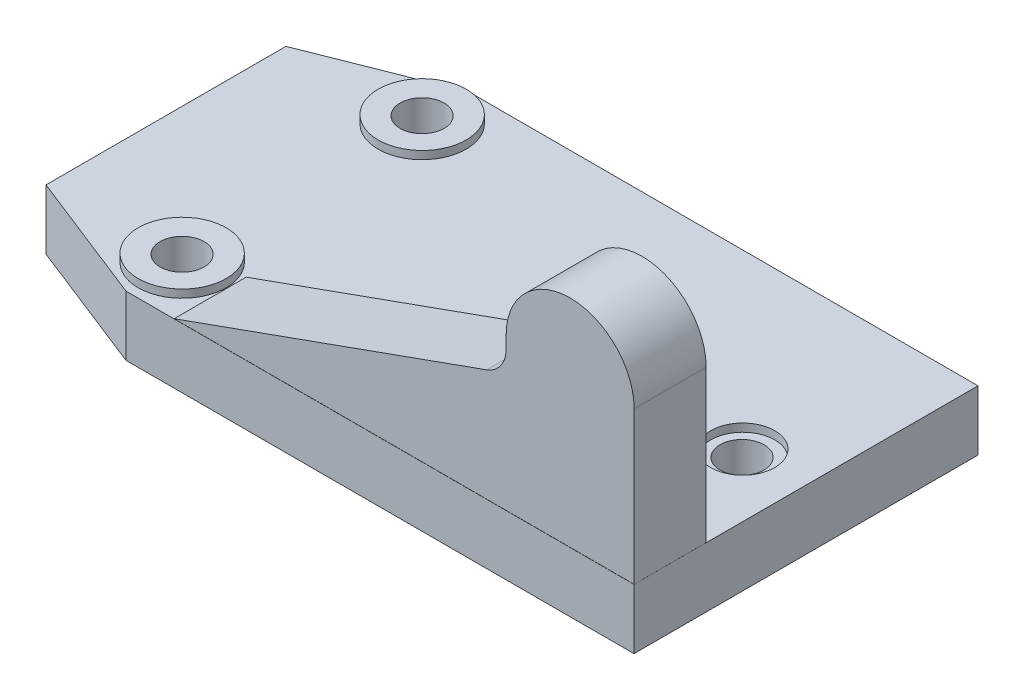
from build123d import *

# Parameters (mm, degrees)
EXTRUSION1_DEPTH        = 15
ESQUISSE4_R             = 11
EXTRUSION3_DEPTH        = 2
ESQUISSE8_R             = 5.5
ENL_V_MAT_EXTRU_4_DEPTH = 184.359126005
ESQUISSE9_R             = 8
ENL_V_MAT_EXTRU_5_DEPTH = 2
EXTRUSION4_DEPTH        = 18


with BuildPart() as part:
    # Esquisse2 → Extrusion1 (new body)
    with BuildSketch(Plane(origin=(0, 0, 0), x_dir=(1, 0, 0), z_dir=(0, 1, 0))):
        Polygon((0, 0), (0, 86), (-127, 86), (-160, 73), (-160, 13), (-127, 0), align=None)
    extrude(amount=EXTRUSION1_DEPTH)

    # Esquisse4 → Extrusion3 (add)
    with BuildSketch(Plane(origin=(-253.198641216, 15, -86.244437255), x_dir=(-1, 0, 0), z_dir=(0, 1, 0))):
        with Locations(Location((-127, 73, 0), (0, 0, 90))):
            Circle(ESQUISSE4_R)
        with Locations(Location((-127, 13, 0), (0, 0, 90))):
            Circle(ESQUISSE4_R)
    extrude(amount=EXTRUSION3_DEPTH)

    # Esquisse8 → Enl_v. mat.-Extru.4 (cut, through all)
    with BuildSketch(Plane(origin=(1.037805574, 17, 0.013919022), x_dir=(1, 0, 0), z_dir=(0, 1, 0))):
        with Locations(Location((-127, 73, 0), (0, 0, 270))):
            Circle(ESQUISSE8_R)
        with Locations(Location((-127, 13, 0), (0, 0, 270))):
            Circle(ESQUISSE8_R)
        with Locations(Location((-17.037805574, 43.013919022, 0), (0, 0, 270))):
            Circle(ESQUISSE8_R)
    extrude(amount=-ENL_V_MAT_EXTRU_4_DEPTH, mode=Mode.SUBTRACT)

    # Esquisse9 → Enl_v. mat.-Extru.5 (cut)
    with BuildSketch(Plane(origin=(-31.69908377, 15, -85.882565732), x_dir=(-1, 0, 0), z_dir=(0, 1, 0))):
        with Locations(Location((-16, 43, 0), (0, 0, 90))):
            Circle(ESQUISSE9_R)
    extrude(amount=-ENL_V_MAT_EXTRU_5_DEPTH, mode=Mode.SUBTRACT)


with BuildPart() as body_2:
    # Esquisse10 → Extrusion4 (new body)
    with BuildSketch(Plane(origin=(0.033825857, 0.041724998, 0), x_dir=(1, 0, 0), z_dir=(0, 0, -1))):
        with BuildLine():
            Line((0, -15), (0, -53))
            ThreePointArc((0, -53), (-16, -69), (-32, -53))
            Line((-32, -53), (-32, -49.912062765))
            ThreePointArc((-32, -49.912062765), (-33.338348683, -45.685666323), (-36.865500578, -43))
            Line((-36.865500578, -43), (-115, -15))
            Line((-115, -15), (0, -15))
        make_face()
    extrude(amount=EXTRUSION4_DEPTH)


solid = Compound([part.part, body_2.part])
